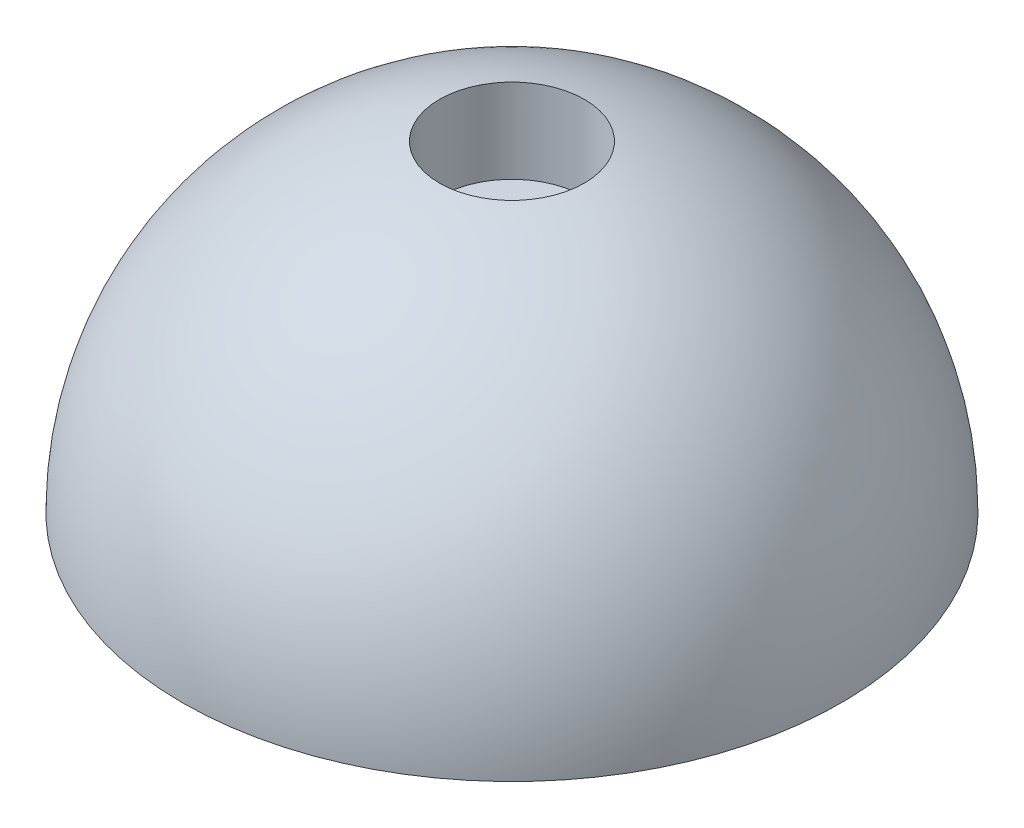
ISO-10303-21;
HEADER;
FILE_DESCRIPTION(('STEP AP214'),'2;1');
FILE_NAME('part.step','',(''),(''),'','','');
FILE_SCHEMA(('AUTOMOTIVE_DESIGN { 1 0 10303 214 1 1 1 1 }'));
ENDSEC;
DATA;
#1=APPLICATION_CONTEXT('core data for automotive mechanical design processes');
#2=APPLICATION_PROTOCOL_DEFINITION('international standard','automotive_design',2000,#1);
#3=PRODUCT_CONTEXT('',#1,'mechanical');
#4=PRODUCT('Part','Part','',(#3));
#5=PRODUCT_RELATED_PRODUCT_CATEGORY('part','',(#4));
#6=PRODUCT_DEFINITION_FORMATION('','',#4);
#7=PRODUCT_DEFINITION_CONTEXT('part definition',#1,'design');
#8=PRODUCT_DEFINITION('design','',#6,#7);
#9=PRODUCT_DEFINITION_SHAPE('','',#8);
#10=(LENGTH_UNIT() NAMED_UNIT(*) SI_UNIT(.MILLI.,.METRE.));
#11=(NAMED_UNIT(*) PLANE_ANGLE_UNIT() SI_UNIT($,.RADIAN.));
#12=(NAMED_UNIT(*) SI_UNIT($,.STERADIAN.) SOLID_ANGLE_UNIT());
#13=UNCERTAINTY_MEASURE_WITH_UNIT(LENGTH_MEASURE(1.E-05),#10,'distance_accuracy_value','');
#14=(GEOMETRIC_REPRESENTATION_CONTEXT(3) GLOBAL_UNCERTAINTY_ASSIGNED_CONTEXT((#13)) GLOBAL_UNIT_ASSIGNED_CONTEXT((#10,
#11,#12)) REPRESENTATION_CONTEXT('',''));
#15=CARTESIAN_POINT('',(0.,0.,0.));
#16=DIRECTION('',(0.,0.,1.));
#17=DIRECTION('',(1.,0.,0.));
#18=AXIS2_PLACEMENT_3D('',#15,#16,#17);
#19=CARTESIAN_POINT('',(0.,0.,0.));
#20=DIRECTION('',(0.,1.,0.));
#21=DIRECTION('',(0.,0.,1.));
#22=AXIS2_PLACEMENT_3D('',#19,#20,#21);
#23=PLANE('',#22);
#24=CARTESIAN_POINT('',(0.,0.,0.));
#25=DIRECTION('',(0.,-1.,0.));
#26=DIRECTION('',(0.,0.,-1.));
#27=AXIS2_PLACEMENT_3D('',#24,#25,#26);
#28=CIRCLE('',#27,2.5);
#29=CARTESIAN_POINT('',(0.,0.,-2.5));
#30=VERTEX_POINT('',#29);
#31=EDGE_CURVE('E39',#30,#30,#28,.T.);
#32=ORIENTED_EDGE('',*,*,#31,.F.);
#33=EDGE_LOOP('',(#32));
#34=FACE_BOUND('',#33,.T.);
#35=CARTESIAN_POINT('',(0.,0.,0.));
#36=DIRECTION('',(0.,1.,0.));
#37=DIRECTION('',(0.,0.,1.));
#38=AXIS2_PLACEMENT_3D('',#35,#36,#37);
#39=CIRCLE('',#38,25.);
#40=CARTESIAN_POINT('',(0.,0.,25.));
#41=VERTEX_POINT('',#40);
#42=EDGE_CURVE('E10',#41,#41,#39,.T.);
#43=ORIENTED_EDGE('',*,*,#42,.F.);
#44=EDGE_LOOP('',(#43));
#45=FACE_BOUND('',#44,.T.);
#46=ADVANCED_FACE('F31',(#34,#45),#23,.F.);
#47=CARTESIAN_POINT('',(0.,0.,0.));
#48=DIRECTION('',(0.,1.,0.));
#49=DIRECTION('',(0.,0.,1.));
#50=AXIS2_PLACEMENT_3D('',#47,#48,#49);
#51=SPHERICAL_SURFACE('',#50,25.);
#52=CARTESIAN_POINT('',(0.,24.3874967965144,0.));
#53=DIRECTION('',(0.,-1.,0.));
#54=DIRECTION('',(0.,0.,-1.));
#55=AXIS2_PLACEMENT_3D('',#52,#53,#54);
#56=CIRCLE('',#55,5.5);
#57=CARTESIAN_POINT('',(0.,24.3874967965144,-5.5));
#58=VERTEX_POINT('',#57);
#59=EDGE_CURVE('E35',#58,#58,#56,.F.);
#60=ORIENTED_EDGE('',*,*,#59,.F.);
#61=EDGE_LOOP('',(#60));
#62=FACE_BOUND('',#61,.T.);
#63=ORIENTED_EDGE('',*,*,#42,.T.);
#64=EDGE_LOOP('',(#63));
#65=FACE_BOUND('',#64,.T.);
#66=ADVANCED_FACE('F33',(#62,#65),#51,.T.);
#67=CARTESIAN_POINT('',(0.,25.,0.));
#68=DIRECTION('',(0.,-1.,0.));
#69=DIRECTION('',(0.,0.,-1.));
#70=AXIS2_PLACEMENT_3D('',#67,#68,#69);
#71=CYLINDRICAL_SURFACE('',#70,2.5);
#72=CARTESIAN_POINT('',(0.,18.,0.));
#73=DIRECTION('',(0.,-1.,0.));
#74=DIRECTION('',(0.,0.,-1.));
#75=AXIS2_PLACEMENT_3D('',#72,#73,#74);
#76=CIRCLE('',#75,2.5);
#77=CARTESIAN_POINT('',(0.,18.,-2.5));
#78=VERTEX_POINT('',#77);
#79=EDGE_CURVE('E46',#78,#78,#76,.F.);
#80=ORIENTED_EDGE('',*,*,#79,.T.);
#81=EDGE_LOOP('',(#80));
#82=FACE_BOUND('',#81,.T.);
#83=ORIENTED_EDGE('',*,*,#31,.T.);
#84=EDGE_LOOP('',(#83));
#85=FACE_BOUND('',#84,.T.);
#86=ADVANCED_FACE('F60',(#82,#85),#71,.F.);
#87=CARTESIAN_POINT('',(0.,18.,0.));
#88=DIRECTION('',(0.,-1.,0.));
#89=DIRECTION('',(0.,0.,-1.));
#90=AXIS2_PLACEMENT_3D('',#87,#88,#89);
#91=PLANE('',#90);
#92=CARTESIAN_POINT('',(0.,18.,0.));
#93=DIRECTION('',(0.,-1.,0.));
#94=DIRECTION('',(0.,0.,-1.));
#95=AXIS2_PLACEMENT_3D('',#92,#93,#94);
#96=CIRCLE('',#95,5.5);
#97=CARTESIAN_POINT('',(0.,18.,-5.5));
#98=VERTEX_POINT('',#97);
#99=EDGE_CURVE('E48',#98,#98,#96,.T.);
#100=ORIENTED_EDGE('',*,*,#99,.F.);
#101=EDGE_LOOP('',(#100));
#102=FACE_BOUND('',#101,.T.);
#103=ORIENTED_EDGE('',*,*,#79,.F.);
#104=EDGE_LOOP('',(#103));
#105=FACE_BOUND('',#104,.T.);
#106=ADVANCED_FACE('F57',(#102,#105),#91,.F.);
#107=CARTESIAN_POINT('',(0.,24.8746859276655,0.));
#108=DIRECTION('',(0.,-1.,0.));
#109=DIRECTION('',(0.,0.,-1.));
#110=AXIS2_PLACEMENT_3D('',#107,#108,#109);
#111=CYLINDRICAL_SURFACE('',#110,5.5);
#112=ORIENTED_EDGE('',*,*,#59,.T.);
#113=EDGE_LOOP('',(#112));
#114=FACE_BOUND('',#113,.T.);
#115=ORIENTED_EDGE('',*,*,#99,.T.);
#116=EDGE_LOOP('',(#115));
#117=FACE_BOUND('',#116,.T.);
#118=ADVANCED_FACE('F55',(#114,#117),#111,.F.);
#119=CLOSED_SHELL('',(#46,#66,#86,#106,#118));
#120=MANIFOLD_SOLID_BREP('B2',#119);
#121=ADVANCED_BREP_SHAPE_REPRESENTATION('',(#18,#120),#14);
#122=SHAPE_DEFINITION_REPRESENTATION(#9,#121);
ENDSEC;
END-ISO-10303-21;
